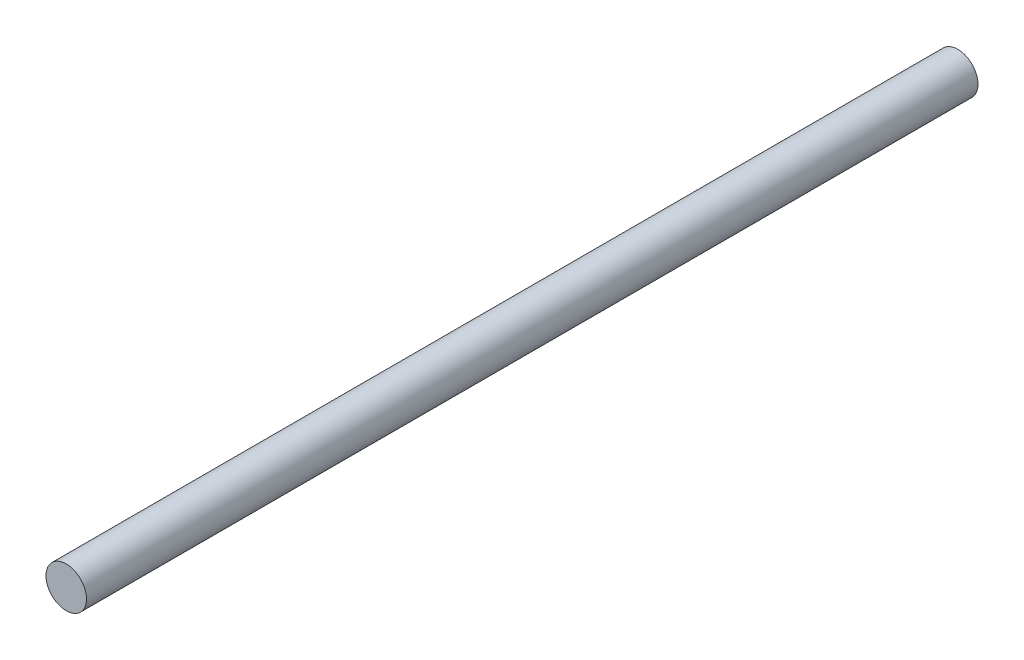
from build123d import *

# Parameters (mm, degrees)
ESQUISSE1_R        = 5
BOSS_EXTRU_1_DEPTH = 220


with BuildPart() as part:
    # Esquisse1 → Boss.-Extru.1 (new body)
    with BuildSketch(Plane.XY):
        Circle(ESQUISSE1_R)
    extrude(amount=BOSS_EXTRU_1_DEPTH)


solid = part.part
